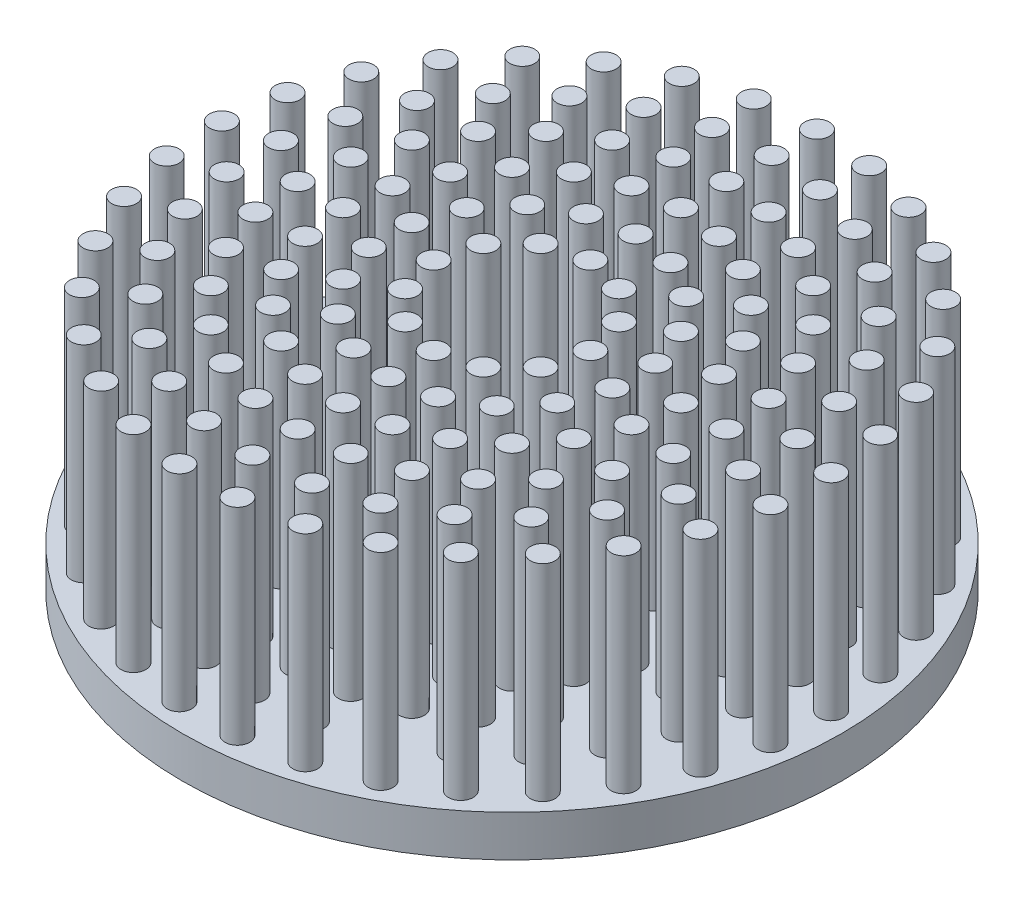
from build123d import *

# Parameters (mm, degrees)
SKETCH_1_R                = 40
EXTRUDE_1_DEPTH           = 3
SKETCH_2_R                = 1.5
EXTRUDE_2_DEPTH           = 27
SKETCH_6_R                = 1.5
EXTRUDE_4_DEPTH           = 27
PATTERN_CIRCULAR_3_COUNT  = 6
SKETCH_7_R                = 1.5
EXTRUDE_5_DEPTH           = 27
PATTERN_CIRCULAR_4_COUNT  = 12
SKETCH_8_R                = 1.5
EXTRUDE_6_DEPTH           = 27
PATTERN_CIRCULAR_5_COUNT  = 18
SKETCH_10_R               = 1.5
EXTRUDE_7_DEPTH           = 27
PATTERN_CIRCULAR_6_COUNT  = 24
SKETCH_11_R               = 1.5
EXTRUDE_8_DEPTH           = 27
PATTERN_CIRCULAR_7_COUNT  = 28
SKETCH_13_R               = 7
CUT_EXTRUDE_3_DEPTH       = 27
SKETCH_15_R               = 1.5
EXTRUDE_10_DEPTH          = 27
PATTERN_CIRCULAR_8_COUNT  = 5
SKETCH_23_R               = 1.5
EXTRUDE_16_DEPTH          = 27
PATTERN_CIRCULAR_9_COUNT  = 30
SKETCH_26_R               = 1.5
EXTRUDE_17_DEPTH          = 27
PATTERN_CIRCULAR_10_COUNT = 33
SKETCH_29_R               = 1.5
EXTRUDE_19_DEPTH          = 37
SKETCH_30_R               = 40
EXTRUDE_20_DEPTH          = 2
M2X0_4_TAPPED_HOLE1_D     = 1.6
M2X0_4_TAPPED_HOLE1_DEPTH = 6
M2X0_4_TAPPED_HOLE1_TIP   = 0.480688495
SKETCH6_R                 = 5.75
EXTRUDE2_DEPTH            = 70.282032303
SKETCH7_R                 = 45.51337789
EXTRUDE3_DEPTH            = 10


with BuildPart() as part:
    # Sketch 1 → Extrude 1 (new body)
    with BuildSketch(Plane(origin=(0, 0, 0), x_dir=(1, 0, 0), z_dir=(0, 1, 0))):
        with Locations(Location((0, 0, 0), (0, 0, 270))):
            Circle(SKETCH_1_R)
    extrude(amount=EXTRUDE_1_DEPTH)

    # Sketch 2 → Extrude 2 (add)
    with BuildSketch(Plane(origin=(0, 3, 0), x_dir=(1, 0, 0), z_dir=(0, 1, 0))):
        with Locations(Location((0, 0, 0), (0, 0, 270))):
            Circle(SKETCH_2_R)
    extrude(amount=EXTRUDE_2_DEPTH)

    # Sketch 6 → Extrude 4 (add)
    with BuildSketch(Plane(origin=(0, 3, 0), x_dir=(1, 0, 0), z_dir=(0, 1, 0))):
        with Locations(Location((0, 5.5, 0), (0, 0, 270))):
            Circle(SKETCH_6_R)
    extrude_4 = extrude(amount=EXTRUDE_4_DEPTH)

    # Pattern Circular 3: Extrude 4 ×6 about axis
    pattern_circular_3_axis = Axis((0, 0, 0), (0, 1, 0))
    for i in range(1, PATTERN_CIRCULAR_3_COUNT):
        add(extrude_4.rotate(pattern_circular_3_axis, i * 360 / PATTERN_CIRCULAR_3_COUNT))

    # Sketch 7 → Extrude 5 (add)
    with BuildSketch(Plane(origin=(0, 3, 0), x_dir=(1, 0, 0), z_dir=(0, 1, 0))):
        with Locations(Location((0, 9.5, 0), (0, 0, 270))):
            Circle(SKETCH_7_R)
    extrude_5 = extrude(amount=EXTRUDE_5_DEPTH)

    # Pattern Circular 4: Extrude 5 ×12 about axis
    pattern_circular_4_axis = Axis((0, 0, 0), (0, 1, 0))
    for i in range(1, PATTERN_CIRCULAR_4_COUNT):
        add(extrude_5.rotate(pattern_circular_4_axis, i * 360 / PATTERN_CIRCULAR_4_COUNT))

    # Sketch 8 → Extrude 6 (add)
    with BuildSketch(Plane(origin=(0, 3, 0), x_dir=(1, 0, 0), z_dir=(0, 1, 0))):
        with Locations(Location((0, 15, 0), (0, 0, 270))):
            Circle(SKETCH_8_R)
    extrude_6 = extrude(amount=EXTRUDE_6_DEPTH)

    # Pattern Circular 5: Extrude 6 ×18 about axis
    pattern_circular_5_axis = Axis((0, 0, 0), (0, 1, 0))
    for i in range(1, PATTERN_CIRCULAR_5_COUNT):
        add(extrude_6.rotate(pattern_circular_5_axis, i * 360 / PATTERN_CIRCULAR_5_COUNT))

    # Sketch 10 → Extrude 7 (add)
    with BuildSketch(Plane(origin=(0, 3, 0), x_dir=(1, 0, 0), z_dir=(0, 1, 0))):
        with Locations(Location((0, 20.5, 0), (0, 0, 270))):
            Circle(SKETCH_10_R)
    extrude_7 = extrude(amount=EXTRUDE_7_DEPTH)

    # Pattern Circular 6: Extrude 7 ×24 about axis
    pattern_circular_6_axis = Axis((0, 0, 0), (0, 1, 0))
    for i in range(1, PATTERN_CIRCULAR_6_COUNT):
        add(extrude_7.rotate(pattern_circular_6_axis, i * 360 / PATTERN_CIRCULAR_6_COUNT))

    # Sketch 11 → Extrude 8 (add)
    with BuildSketch(Plane(origin=(0, 3, 0), x_dir=(1, 0, 0), z_dir=(0, 1, 0))):
        with Locations(Location((0, 26, 0), (0, 0, 270))):
            Circle(SKETCH_11_R)
    extrude_8 = extrude(amount=EXTRUDE_8_DEPTH)

    # Pattern Circular 7: Extrude 8 ×28 about axis
    pattern_circular_7_axis = Axis((0, 0, 0), (0, 1, 0))
    for i in range(1, PATTERN_CIRCULAR_7_COUNT):
        add(extrude_8.rotate(pattern_circular_7_axis, i * 360 / PATTERN_CIRCULAR_7_COUNT))

    # Sketch 13 → Cut-Extrude 3 (cut)
    with BuildSketch(Plane(origin=(0, 3, 0), x_dir=(1, 0, 0), z_dir=(0, 1, 0))):
        Circle(SKETCH_13_R)
    extrude(amount=CUT_EXTRUDE_3_DEPTH, mode=Mode.SUBTRACT)

    # Sketch 15 → Extrude 10 (add)
    with BuildSketch(Plane(origin=(0, 3, 0), x_dir=(1, 0, 0), z_dir=(0, 1, 0))):
        with Locations(Location((0, 4, 0), (0, 0, 270))):
            Circle(SKETCH_15_R)
    extrude_10 = extrude(amount=EXTRUDE_10_DEPTH)

    # Pattern Circular 8: Extrude 10 ×5 about axis
    pattern_circular_8_axis = Axis((0, 0, 0), (0, 1, 0))
    for i in range(1, PATTERN_CIRCULAR_8_COUNT):
        add(extrude_10.rotate(pattern_circular_8_axis, i * 360 / PATTERN_CIRCULAR_8_COUNT))

    # Sketch 23 → Extrude 16 (add)
    with BuildSketch(Plane(origin=(0, 3, 0), x_dir=(1, 0, 0), z_dir=(0, 1, 0))):
        with Locations(Location((0, 31.5, 0), (0, 0, 270))):
            Circle(SKETCH_23_R)
    extrude_16 = extrude(amount=EXTRUDE_16_DEPTH)

    # Pattern Circular 9: Extrude 16 ×30 about axis
    pattern_circular_9_axis = Axis((0, 0, 0), (0, 1, 0))
    for i in range(1, PATTERN_CIRCULAR_9_COUNT):
        add(extrude_16.rotate(pattern_circular_9_axis, i * 360 / PATTERN_CIRCULAR_9_COUNT))

    # Sketch 26 → Extrude 17 (add)
    with BuildSketch(Plane(origin=(0, 3, 0), x_dir=(1, 0, 0), z_dir=(0, 1, 0))):
        with Locations(Location((0, 37, 0), (0, 0, 270))):
            Circle(SKETCH_26_R)
    extrude_17 = extrude(amount=EXTRUDE_17_DEPTH)

    # Pattern Circular 10: Extrude 17 ×33 about axis
    pattern_circular_10_axis = Axis((0, 0, 0), (0, 1, 0))
    for i in range(1, PATTERN_CIRCULAR_10_COUNT):
        add(extrude_17.rotate(pattern_circular_10_axis, i * 360 / PATTERN_CIRCULAR_10_COUNT))

    # Sketch 29 → Extrude 19 (add)
    with BuildSketch(Plane(origin=(0, 3, 0), x_dir=(1, 0, 0), z_dir=(0, 1, 0))):
        with Locations(Location((-17.753520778, -10.25, 0), (0, 0, 30))):
            Circle(SKETCH_29_R)
        with Locations(Location((-14.772116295, -2.604722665, 0), (0, 0, 10))):
            Circle(SKETCH_29_R)
        with Locations(Location((-19.801479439, -5.305790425, 0), (0, 0, 15))):
            Circle(SKETCH_29_R)
        with Locations(Location((-19.801479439, 5.305790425, 0), (0, 0, 345))):
            Circle(SKETCH_29_R)
        with Locations(Location((-17.753520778, 10.25, 0), (0, 0, 330))):
            Circle(SKETCH_29_R)
        with Locations(Location((-12.990381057, 7.5, 0), (0, 0, 330))):
            Circle(SKETCH_29_R)
        with Locations(Location((-9.641814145, 11.490666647, 0), (0, 0, 310))):
            Circle(SKETCH_29_R)
        with Locations(Location((-14.495689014, 14.495689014, 0), (0, 0, 315))):
            Circle(SKETCH_29_R)
        with Locations(Location((-10.25, 17.753520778, 0), (0, 0, 300))):
            Circle(SKETCH_29_R)
        with Locations(Location((-4.75, 8.227241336, 0), (0, 0, 300))):
            Circle(SKETCH_29_R)
        with Locations(Location((9.641814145, 11.490666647, 0), (0, 0, 230))):
            Circle(SKETCH_29_R)
        with Locations(Location((12.990381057, 7.5, 0), (0, 0, 210))):
            Circle(SKETCH_29_R)
        with Locations(Location((14.772116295, 2.604722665, 0), (0, 0, 190))):
            Circle(SKETCH_29_R)
        with Locations(Location((8.227241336, 4.75, 0), (0, 0, 210))):
            Circle(SKETCH_29_R)
        with Locations(Location((3.804226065, 1.236067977, 0), (0, 0, 198))):
            Circle(SKETCH_29_R)
        with Locations(Location((19.801479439, -5.305790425, 0), (0, 0, 165))):
            Circle(SKETCH_29_R)
        with Locations(Location((0, 26, 0), (0, 0, 270))):
            Circle(SKETCH_29_R)
        with Locations(Location((-6.549218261, 30.811649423, 0), (0, 0, 282))):
            Circle(SKETCH_29_R)
        with Locations(Location((-5.305790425, -19.801479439, 0), (0, 0, 75))):
            Circle(SKETCH_29_R)
        with Locations(Location((12.990381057, -7.5, 0), (0, 0, 150))):
            Circle(SKETCH_29_R)
        with Locations(Location((9.641814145, -11.490666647, 0), (0, 0, 130))):
            Circle(SKETCH_29_R)
        with Locations(Location((5.13030215, -14.095389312, 0), (0, 0, 110))):
            Circle(SKETCH_29_R)
        with Locations(Location((0, -9.5, 0), (0, 0, 90))):
            Circle(SKETCH_29_R)
        with Locations(Location((8.227241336, -4.75, 0), (0, 0, 150))):
            Circle(SKETCH_29_R)
        with Locations(Location((2.351141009, -3.236067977, 0), (0, 0, 126))):
            Circle(SKETCH_29_R)
        with Locations(Location((0, 4, 0), (0, 0, 270))):
            Circle(SKETCH_29_R)
        with Locations(Location((-8.227241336, 4.75, 0), (0, 0, 330))):
            Circle(SKETCH_29_R)
        with Locations((-9.5, 0)):
            Circle(SKETCH_29_R)
        with Locations(Location((-8.227241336, -4.75, 0), (0, 0, 30))):
            Circle(SKETCH_29_R)
        with Locations(Location((-4.75, -8.227241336, 0), (0, 0, 60))):
            Circle(SKETCH_29_R)
        with Locations(Location((-5.13030215, -14.095389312, 0), (0, 0, 70))):
            Circle(SKETCH_29_R)
        with Locations(Location((-10.25, -17.753520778, 0), (0, 0, 60))):
            Circle(SKETCH_29_R)
        with Locations(Location((-23.425190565, -11.280977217, 0), (0, 0, 25.714285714))):
            Circle(SKETCH_29_R)
        with Locations(Location((-29.958280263, -9.734035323, 0), (0, 0, 18))):
            Circle(SKETCH_29_R)
        with Locations((-26, 0)):
            Circle(SKETCH_29_R)
        with Locations(Location((-23.425190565, 11.280977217, 0), (0, 0, 334.285714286))):
            Circle(SKETCH_29_R)
        with Locations(Location((-18.515235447, 25.484035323, 0), (0, 0, 306))):
            Circle(SKETCH_29_R)
        with Locations(Location((-12.812204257, 28.776681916, 0), (0, 0, 294))):
            Circle(SKETCH_29_R)
        with Locations(Location((5.13030215, 14.095389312, 0), (0, 0, 250))):
            Circle(SKETCH_29_R)
        with Locations(Location((5.305790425, 19.801479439, 0), (0, 0, 255))):
            Circle(SKETCH_29_R)
        with Locations(Location((10.25, 17.753520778, 0), (0, 0, 240))):
            Circle(SKETCH_29_R)
        with Locations(Location((14.495689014, 14.495689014, 0), (0, 0, 225))):
            Circle(SKETCH_29_R)
        with Locations(Location((19.801479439, 5.305790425, 0), (0, 0, 195))):
            Circle(SKETCH_29_R)
        with Locations(Location((29.958280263, 9.734035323, 0), (0, 0, 198))):
            Circle(SKETCH_29_R)
        with Locations(Location((23.425190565, 11.280977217, 0), (0, 0, 205.714285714))):
            Circle(SKETCH_29_R)
        with Locations(Location((20.327618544, 16.210734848, 0), (0, 0, 218.571428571))):
            Circle(SKETCH_29_R)
        with Locations(Location((16.210734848, 20.327618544, 0), (0, 0, 231.428571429))):
            Circle(SKETCH_29_R)
        with Locations(Location((5.785544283, 25.348125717, 0), (0, 0, 257.142857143))):
            Circle(SKETCH_29_R)
        with Locations(Location((0, 9.5, 0), (0, 0, 270))):
            Circle(SKETCH_29_R)
        with Locations(Location((4.75, 8.227241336, 0), (0, 0, 240))):
            Circle(SKETCH_29_R)
        with Locations(Location((9.5, 0, 0), (0, 0, 180))):
            Circle(SKETCH_29_R)
        with Locations(Location((14.772116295, -2.604722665, 0), (0, 0, 170))):
            Circle(SKETCH_29_R)
        with Locations(Location((20.5, 0, 0), (0, 0, 180))):
            Circle(SKETCH_29_R)
        with Locations(Location((25.348125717, -5.785544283, 0), (0, 0, 167.142857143))):
            Circle(SKETCH_29_R)
        with Locations(Location((23.425190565, -11.280977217, 0), (0, 0, 154.285714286))):
            Circle(SKETCH_29_R)
        with Locations(Location((12.812204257, -28.776681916, 0), (0, 0, 114))):
            Circle(SKETCH_29_R)
        with Locations(Location((6.549218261, -30.811649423, 0), (0, 0, 102))):
            Circle(SKETCH_29_R)
        with Locations(Location((5.785544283, -25.348125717, 0), (0, 0, 102.857142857))):
            Circle(SKETCH_29_R)
        with Locations(Location((0, -31.5, 0), (0, 0, 90))):
            Circle(SKETCH_29_R)
        with Locations(Location((-6.549218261, -30.811649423, 0), (0, 0, 78))):
            Circle(SKETCH_29_R)
        with Locations(Location((-12.812204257, -28.776681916, 0), (0, 0, 66))):
            Circle(SKETCH_29_R)
        with Locations(Location((-18.515235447, -25.484035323, 0), (0, 0, 54))):
            Circle(SKETCH_29_R)
        with Locations(Location((-16.210734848, -20.327618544, 0), (0, 0, 51.428571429))):
            Circle(SKETCH_29_R)
        with Locations(Location((-23.409062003, -21.0776141, 0), (0, 0, 42))):
            Circle(SKETCH_29_R)
        with Locations(Location((0, -20.5, 0), (0, 0, 90))):
            Circle(SKETCH_29_R)
        with Locations(Location((5.305790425, -19.801479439, 0), (0, 0, 105))):
            Circle(SKETCH_29_R)
        with Locations(Location((10.25, -17.753520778, 0), (0, 0, 120))):
            Circle(SKETCH_29_R)
        with Locations(Location((14.495689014, -14.495689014, 0), (0, 0, 135))):
            Circle(SKETCH_29_R)
        with Locations(Location((17.753520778, -10.25, 0), (0, 0, 150))):
            Circle(SKETCH_29_R)
        with Locations(Location((0, -15, 0), (0, 0, 90))):
            Circle(SKETCH_29_R)
        with Locations(Location((4.75, -8.227241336, 0), (0, 0, 120))):
            Circle(SKETCH_29_R)
        with Locations(Location((-2.351141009, -3.236067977, 0), (0, 0, 54))):
            Circle(SKETCH_29_R)
        with Locations(Location((-3.804226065, 1.236067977, 0), (0, 0, 342))):
            Circle(SKETCH_29_R)
        with Locations(Location((-14.495689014, -14.495689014, 0), (0, 0, 45))):
            Circle(SKETCH_29_R)
        with Locations(Location((-9.641814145, -11.490666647, 0), (0, 0, 50))):
            Circle(SKETCH_29_R)
        with Locations(Location((-12.990381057, -7.5, 0), (0, 0, 30))):
            Circle(SKETCH_29_R)
        with Locations((-20.5, 0)):
            Circle(SKETCH_29_R)
        with Locations(Location((-14.772116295, 2.604722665, 0), (0, 0, 350))):
            Circle(SKETCH_29_R)
        with Locations(Location((-5.13030215, 14.095389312, 0), (0, 0, 290))):
            Circle(SKETCH_29_R)
        with Locations(Location((-25.532923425, 26.77815941, 0), (0, 0, 313.636363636))):
            Circle(SKETCH_29_R)
        with Locations(Location((-30.139310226, 21.462105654, 0), (0, 0, 324.545454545))):
            Circle(SKETCH_29_R)
        with Locations(Location((-33.656383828, 15.370355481, 0), (0, 0, 335.454545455))):
            Circle(SKETCH_29_R)
        with Locations(Location((-35.957028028, 8.723080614, 0), (0, 0, 346.363636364))):
            Circle(SKETCH_29_R)
        with Locations(Location((-36.95809155, 1.760530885, 0), (0, 0, 357.272727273))):
            Circle(SKETCH_29_R)
        with Locations(Location((-22.87188249, -29.083964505, 0), (0, 0, 51.818181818))):
            Circle(SKETCH_29_R)
        with Locations(Location((-10.424104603, -35.501240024, 0), (0, 0, 73.636363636))):
            Circle(SKETCH_29_R)
        with Locations(Location((-3.517073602, -36.832461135, 0), (0, 0, 84.545454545))):
            Circle(SKETCH_29_R)
        with Locations(Location((22.87188249, -29.083964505, 0), (0, 0, 128.181818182))):
            Circle(SKETCH_29_R)
        with Locations(Location((36.62339335, -5.265649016, 0), (0, 0, 171.818181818))):
            Circle(SKETCH_29_R)
        with Locations(Location((20.003710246, 31.126380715, 0), (0, 0, 237.272727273))):
            Circle(SKETCH_29_R)
        with Locations(Location((13.751510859, 34.349613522, 0), (0, 0, 248.181818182))):
            Circle(SKETCH_29_R)
        with Locations(Location((7.002296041, 36.331361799, 0), (0, 0, 259.090909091))):
            Circle(SKETCH_29_R)
        with Locations(Location((0, 37, 0), (0, 0, 270))):
            Circle(SKETCH_29_R)
        with Locations(Location((-20.003710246, 31.126380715, 0), (0, 0, 302.727272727))):
            Circle(SKETCH_29_R)
        with Locations(Location((-32.04293994, -18.5, 0), (0, 0, 30))):
            Circle(SKETCH_29_R)
        with Locations(Location((-27.962734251, -24.229847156, 0), (0, 0, 40.909090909))):
            Circle(SKETCH_29_R)
        with Locations(Location((-16.954381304, -32.8869116, 0), (0, 0, 62.727272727))):
            Circle(SKETCH_29_R)
        with Locations(Location((3.517073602, -36.832461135, 0), (0, 0, 95.454545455))):
            Circle(SKETCH_29_R)
        with Locations(Location((10.424104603, -35.501240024, 0), (0, 0, 106.363636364))):
            Circle(SKETCH_29_R)
        with Locations(Location((16.954381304, -32.8869116, 0), (0, 0, 117.272727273))):
            Circle(SKETCH_29_R)
        with Locations(Location((27.962734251, -24.229847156, 0), (0, 0, 139.090909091))):
            Circle(SKETCH_29_R)
        with Locations(Location((32.04293994, -18.5, 0), (0, 0, 150))):
            Circle(SKETCH_29_R)
        with Locations(Location((34.965030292, -12.101514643, 0), (0, 0, 160.909090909))):
            Circle(SKETCH_29_R)
        with Locations(Location((36.95809155, 1.760530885, 0), (0, 0, 182.727272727))):
            Circle(SKETCH_29_R)
        with Locations(Location((35.957028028, 8.723080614, 0), (0, 0, 193.636363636))):
            Circle(SKETCH_29_R)
        with Locations(Location((33.656383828, 15.370355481, 0), (0, 0, 204.545454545))):
            Circle(SKETCH_29_R)
        with Locations(Location((30.139310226, 21.462105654, 0), (0, 0, 215.454545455))):
            Circle(SKETCH_29_R)
        with Locations(Location((25.532923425, 26.77815941, 0), (0, 0, 226.363636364))):
            Circle(SKETCH_29_R)
        with Locations(Location((-7.002296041, 36.331361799, 0), (0, 0, 280.909090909))):
            Circle(SKETCH_29_R)
        with Locations(Location((-13.751510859, 34.349613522, 0), (0, 0, 291.818181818))):
            Circle(SKETCH_29_R)
        with Locations(Location((-36.62339335, -5.265649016, 0), (0, 0, 8.181818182))):
            Circle(SKETCH_29_R)
        with Locations(Location((-34.965030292, -12.101514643, 0), (0, 0, 19.090909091))):
            Circle(SKETCH_29_R)
        with Locations(Location((23.409062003, 21.0776141, 0), (0, 0, 222))):
            Circle(SKETCH_29_R)
        with Locations(Location((18.515235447, 25.484035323, 0), (0, 0, 234))):
            Circle(SKETCH_29_R)
        with Locations(Location((11.280977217, 23.425190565, 0), (0, 0, 244.285714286))):
            Circle(SKETCH_29_R)
        with Locations(Location((12.812204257, 28.776681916, 0), (0, 0, 246))):
            Circle(SKETCH_29_R)
        with Locations(Location((6.549218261, 30.811649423, 0), (0, 0, 258))):
            Circle(SKETCH_29_R)
        with Locations(Location((0, 31.5, 0), (0, 0, 270))):
            Circle(SKETCH_29_R)
        with Locations(Location((-31.327439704, -3.292646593, 0), (0, 0, 6))):
            Circle(SKETCH_29_R)
        with Locations(Location((-31.327439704, 3.292646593, 0), (0, 0, 354))):
            Circle(SKETCH_29_R)
        with Locations(Location((-29.958280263, 9.734035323, 0), (0, 0, 342))):
            Circle(SKETCH_29_R)
        with Locations(Location((-25.348125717, 5.785544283, 0), (0, 0, 347.142857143))):
            Circle(SKETCH_29_R)
        with Locations(Location((-27.279800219, 15.75, 0), (0, 0, 330))):
            Circle(SKETCH_29_R)
        with Locations(Location((-20.327618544, 16.210734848, 0), (0, 0, 321.428571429))):
            Circle(SKETCH_29_R)
        with Locations(Location((-23.409062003, 21.0776141, 0), (0, 0, 318))):
            Circle(SKETCH_29_R)
        with Locations(Location((-16.210734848, 20.327618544, 0), (0, 0, 308.571428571))):
            Circle(SKETCH_29_R)
        with Locations(Location((-11.280977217, 23.425190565, 0), (0, 0, 295.714285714))):
            Circle(SKETCH_29_R)
        with Locations(Location((-5.785544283, 25.348125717, 0), (0, 0, 282.857142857))):
            Circle(SKETCH_29_R)
        with Locations(Location((-5.305790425, 19.801479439, 0), (0, 0, 285))):
            Circle(SKETCH_29_R)
        with Locations(Location((0, 20.5, 0), (0, 0, 270))):
            Circle(SKETCH_29_R)
        with Locations(Location((0, 15, 0), (0, 0, 270))):
            Circle(SKETCH_29_R)
        with Locations(Location((17.753520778, 10.25, 0), (0, 0, 210))):
            Circle(SKETCH_29_R)
        with Locations(Location((25.348125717, 5.785544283, 0), (0, 0, 192.857142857))):
            Circle(SKETCH_29_R)
        with Locations(Location((27.279800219, 15.75, 0), (0, 0, 210))):
            Circle(SKETCH_29_R)
        with Locations(Location((26, 0, 0), (0, 0, 180))):
            Circle(SKETCH_29_R)
        with Locations(Location((31.327439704, -3.292646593, 0), (0, 0, 174))):
            Circle(SKETCH_29_R)
        with Locations(Location((31.327439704, 3.292646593, 0), (0, 0, 186))):
            Circle(SKETCH_29_R)
        with Locations(Location((29.958280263, -9.734035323, 0), (0, 0, 162))):
            Circle(SKETCH_29_R)
        with Locations(Location((27.279800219, -15.75, 0), (0, 0, 150))):
            Circle(SKETCH_29_R)
        with Locations(Location((20.327618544, -16.210734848, 0), (0, 0, 141.428571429))):
            Circle(SKETCH_29_R)
        with Locations(Location((23.409062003, -21.0776141, 0), (0, 0, 138))):
            Circle(SKETCH_29_R)
        with Locations(Location((16.210734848, -20.327618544, 0), (0, 0, 128.571428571))):
            Circle(SKETCH_29_R)
        with Locations(Location((18.515235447, -25.484035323, 0), (0, 0, 126))):
            Circle(SKETCH_29_R)
        with Locations(Location((11.280977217, -23.425190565, 0), (0, 0, 115.714285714))):
            Circle(SKETCH_29_R)
        with Locations(Location((0, -26, 0), (0, 0, 90))):
            Circle(SKETCH_29_R)
        with Locations(Location((-5.785544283, -25.348125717, 0), (0, 0, 77.142857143))):
            Circle(SKETCH_29_R)
        with Locations(Location((-11.280977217, -23.425190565, 0), (0, 0, 64.285714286))):
            Circle(SKETCH_29_R)
        with Locations(Location((-20.327618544, -16.210734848, 0), (0, 0, 38.571428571))):
            Circle(SKETCH_29_R)
        with Locations(Location((-27.279800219, -15.75, 0), (0, 0, 30))):
            Circle(SKETCH_29_R)
        with Locations(Location((-25.348125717, -5.785544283, 0), (0, 0, 12.857142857))):
            Circle(SKETCH_29_R)
    extrude(amount=EXTRUDE_19_DEPTH)

    # Sketch 30 → Extrude 20 (add)
    with BuildSketch(Plane(origin=(0, 3, 0), x_dir=(1, 0, 0), z_dir=(0, 1, 0))):
        with Locations(Location((0, 0, 0), (0, 0, 270))):
            Circle(SKETCH_30_R)
    extrude(amount=EXTRUDE_20_DEPTH)

    # M2x0.4 Tapped Hole1
    with Locations(Plane.XZ):
        with Locations((-2.545260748, 19.333174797), (-15.470390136, -11.870847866), (18.015650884, -7.462326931)):
            Hole(M2X0_4_TAPPED_HOLE1_D / 2, depth=M2X0_4_TAPPED_HOLE1_DEPTH)
            with Locations((0, 0, -(M2X0_4_TAPPED_HOLE1_DEPTH + M2X0_4_TAPPED_HOLE1_TIP / 2))):  # 118° drill point
                Cone(0, M2X0_4_TAPPED_HOLE1_D / 2, M2X0_4_TAPPED_HOLE1_TIP, mode=Mode.SUBTRACT)

    # Sketch6 → Extrude2 (cut, through all)
    with BuildSketch(Plane.XZ):
        with Locations(Location((0, 0, 0), (0, 0, 270))):
            Circle(SKETCH6_R)
    extrude(amount=-EXTRUDE2_DEPTH, mode=Mode.SUBTRACT)

    # Sketch7 → Extrude3 (cut)
    with BuildSketch(Plane(origin=(0, 40, 0), x_dir=(1, 0, 0), z_dir=(0, 1, 0))):
        Circle(SKETCH7_R)
    extrude(amount=-EXTRUDE3_DEPTH, mode=Mode.SUBTRACT)


solid = part.part
